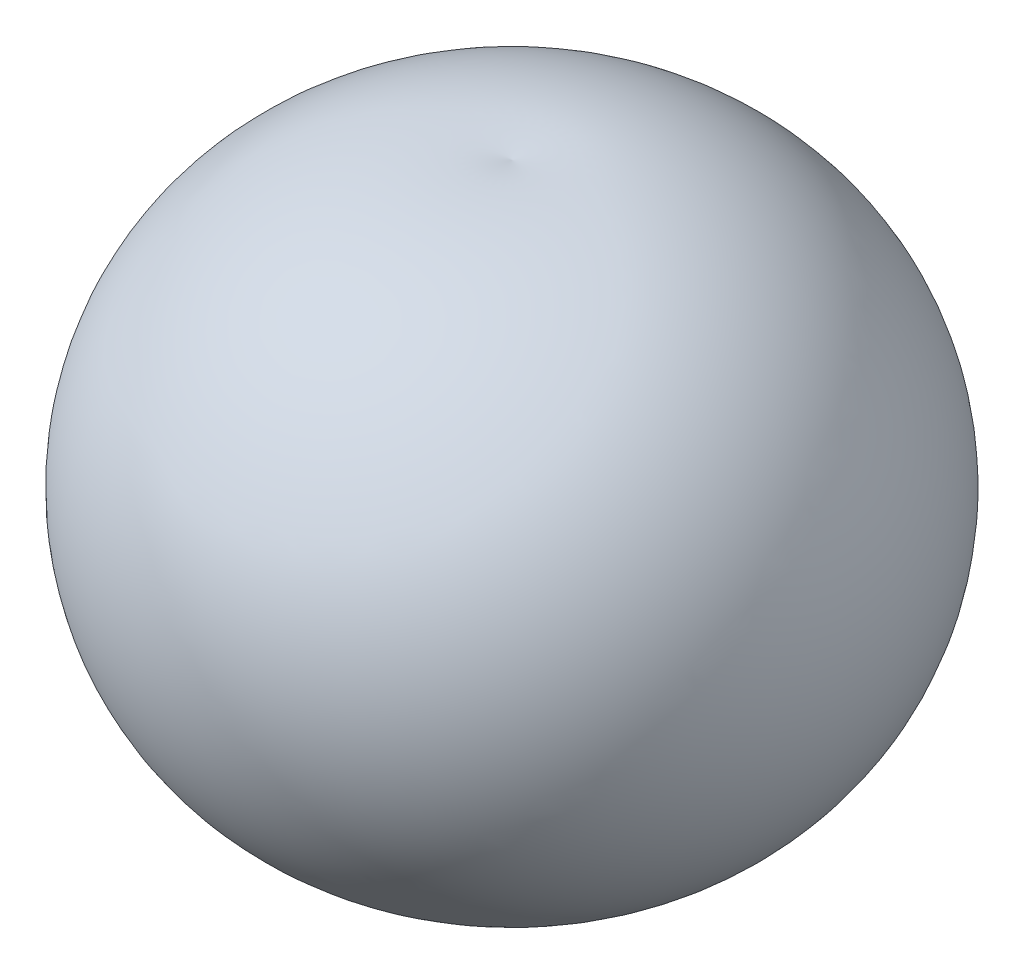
ISO-10303-21;
HEADER;
FILE_DESCRIPTION(('STEP AP214'),'2;1');
FILE_NAME('part.step','',(''),(''),'','','');
FILE_SCHEMA(('AUTOMOTIVE_DESIGN { 1 0 10303 214 1 1 1 1 }'));
ENDSEC;
DATA;
#1=APPLICATION_CONTEXT('core data for automotive mechanical design processes');
#2=APPLICATION_PROTOCOL_DEFINITION('international standard','automotive_design',2000,#1);
#3=PRODUCT_CONTEXT('',#1,'mechanical');
#4=PRODUCT('Part','Part','',(#3));
#5=PRODUCT_RELATED_PRODUCT_CATEGORY('part','',(#4));
#6=PRODUCT_DEFINITION_FORMATION('','',#4);
#7=PRODUCT_DEFINITION_CONTEXT('part definition',#1,'design');
#8=PRODUCT_DEFINITION('design','',#6,#7);
#9=PRODUCT_DEFINITION_SHAPE('','',#8);
#10=(LENGTH_UNIT() NAMED_UNIT(*) SI_UNIT(.MILLI.,.METRE.));
#11=(NAMED_UNIT(*) PLANE_ANGLE_UNIT() SI_UNIT($,.RADIAN.));
#12=(NAMED_UNIT(*) SI_UNIT($,.STERADIAN.) SOLID_ANGLE_UNIT());
#13=UNCERTAINTY_MEASURE_WITH_UNIT(LENGTH_MEASURE(1.E-05),#10,'distance_accuracy_value','');
#14=(GEOMETRIC_REPRESENTATION_CONTEXT(3) GLOBAL_UNCERTAINTY_ASSIGNED_CONTEXT((#13)) GLOBAL_UNIT_ASSIGNED_CONTEXT((#10,
#11,#12)) REPRESENTATION_CONTEXT('',''));
#15=CARTESIAN_POINT('',(0.,0.,0.));
#16=DIRECTION('',(0.,0.,1.));
#17=DIRECTION('',(1.,0.,0.));
#18=AXIS2_PLACEMENT_3D('',#15,#16,#17);
#19=CARTESIAN_POINT('',(-485.,-99.6152422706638,0.));
#20=DIRECTION('',(0.,0.,-1.));
#21=DIRECTION('',(-1.,0.,0.));
#22=AXIS2_PLACEMENT_3D('',#19,#20,#21);
#23=CIRCLE('',#22,635.433710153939);
#24=TRIMMED_CURVE('',#23,(PARAMETER_VALUE(-2.4391374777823)),(PARAMETER_VALUE(2.4391374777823)),
.T.,.PARAMETER.);
#25=CARTESIAN_POINT('',(2.22044604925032E-13,-99.6152422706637,0.));
#26=DIRECTION('',(0.,1.,0.));
#27=AXIS1_PLACEMENT('',#25,#26);
#28=SURFACE_OF_REVOLUTION('',#24,#27);
#29=CARTESIAN_POINT('',(2.95583160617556E-13,-649.916977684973,0.));
#30=DIRECTION('',(0.,1.,0.));
#31=DIRECTION('',(-1.,0.,0.));
#32=AXIS2_PLACEMENT_3D('',#29,#30,#31);
#33=CIRCLE('',#32,802.716855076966);
#34=CARTESIAN_POINT('',(-802.716855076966,-649.916977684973,0.));
#35=VERTEX_POINT('',#34);
#36=EDGE_CURVE('E25',#35,#35,#33,.T.);
#37=ORIENTED_EDGE('',*,*,#36,.F.);
#38=EDGE_LOOP('',(#37));
#39=FACE_BOUND('',#38,.T.);
#40=CARTESIAN_POINT('',(2.63769416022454E-13,-510.164873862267,0.));
#41=VERTEX_POINT('',#40);
#42=VERTEX_LOOP('',#41);
#43=FACE_BOUND('',#42,.T.);
#44=ADVANCED_FACE('F16',(#39,#43),#28,.T.);
#45=CARTESIAN_POINT('',(-185.,420.,0.));
#46=DIRECTION('',(0.,0.,-1.));
#47=DIRECTION('',(-1.,0.,0.));
#48=AXIS2_PLACEMENT_3D('',#45,#46,#47);
#49=CIRCLE('',#48,1235.43371015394);
#50=TRIMMED_CURVE('',#49,(PARAMETER_VALUE(-1.7211066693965)),(PARAMETER_VALUE(1.7211066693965)),
.T.,.PARAMETER.);
#51=CARTESIAN_POINT('',(1.66533453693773E-13,420.,0.));
#52=DIRECTION('',(0.,1.,0.));
#53=AXIS1_PLACEMENT('',#51,#52);
#54=SURFACE_OF_REVOLUTION('',#50,#53);
#55=CARTESIAN_POINT('',(0.,1641.50376675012,0.));
#56=VERTEX_POINT('',#55);
#57=VERTEX_LOOP('',#56);
#58=FACE_BOUND('',#57,.T.);
#59=ORIENTED_EDGE('',*,*,#36,.T.);
#60=EDGE_LOOP('',(#59));
#61=FACE_BOUND('',#60,.T.);
#62=ADVANCED_FACE('F50',(#58,#61),#54,.T.);
#63=CLOSED_SHELL('',(#44,#62));
#64=CARTESIAN_POINT('',(412.716818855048,472.293445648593,0.));
#65=DIRECTION('',(0.,0.,-1.));
#66=DIRECTION('',(-1.,0.,0.));
#67=AXIS2_PLACEMENT_3D('',#64,#65,#66);
#68=CIRCLE('',#67,635.433710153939);
#69=TRIMMED_CURVE('',#68,(PARAMETER_VALUE(-0.863864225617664)),
(PARAMETER_VALUE(0.863864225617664)),.T.,.PARAMETER.);
#70=CARTESIAN_POINT('',(1.66533453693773E-13,472.293445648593,0.));
#71=DIRECTION('',(0.,1.,0.));
#72=AXIS1_PLACEMENT('',#70,#71);
#73=SURFACE_OF_REVOLUTION('',#69,#72);
#74=CARTESIAN_POINT('',(1.04208314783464E-13,955.450591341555,0.));
#75=VERTEX_POINT('',#74);
#76=VERTEX_LOOP('',#75);
#77=FACE_BOUND('',#76,.T.);
#78=CARTESIAN_POINT('',(1.28386955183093E-13,646.22199289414,0.));
#79=DIRECTION('',(0.,1.,0.));
#80=DIRECTION('',(-1.,0.,0.));
#81=AXIS2_PLACEMENT_3D('',#78,#79,#80);
#82=CIRCLE('',#81,198.449983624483);
#83=CARTESIAN_POINT('',(-198.449983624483,646.22199289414,0.));
#84=VERTEX_POINT('',#83);
#85=EDGE_CURVE('E9',#84,#84,#82,.T.);
#86=ORIENTED_EDGE('',*,*,#85,.F.);
#87=EDGE_LOOP('',(#86));
#88=FACE_BOUND('',#87,.T.);
#89=ADVANCED_FACE('F18',(#77,#88),#73,.F.);
#90=CARTESIAN_POINT('',(-185.,420.,0.));
#91=DIRECTION('',(0.,0.,-1.));
#92=DIRECTION('',(-1.,0.,0.));
#93=AXIS2_PLACEMENT_3D('',#90,#91,#92);
#94=CIRCLE('',#93,226.621473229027);
#95=TRIMMED_CURVE('',#94,(PARAMETER_VALUE(-2.52584046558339)),
(PARAMETER_VALUE(2.52584046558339)),.T.,.PARAMETER.);
#96=CARTESIAN_POINT('',(1.66533453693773E-13,420.,0.));
#97=DIRECTION('',(0.,1.,0.));
#98=AXIS1_PLACEMENT('',#96,#97);
#99=SURFACE_OF_REVOLUTION('',#95,#98);
#100=ORIENTED_EDGE('',*,*,#85,.T.);
#101=EDGE_LOOP('',(#100));
#102=FACE_BOUND('',#101,.T.);
#103=CARTESIAN_POINT('',(1.55662159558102E-13,289.109617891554,0.));
#104=VERTEX_POINT('',#103);
#105=VERTEX_LOOP('',#104);
#106=FACE_BOUND('',#105,.T.);
#107=ADVANCED_FACE('F38',(#102,#106),#99,.F.);
#108=CLOSED_SHELL('',(#89,#107));
#109=ORIENTED_CLOSED_SHELL('',*,#108,.T.);
#110=BREP_WITH_VOIDS('B1',#63,(#109));
#111=ADVANCED_BREP_SHAPE_REPRESENTATION('',(#18,#110),#14);
#112=SHAPE_DEFINITION_REPRESENTATION(#9,#111);
ENDSEC;
END-ISO-10303-21;
